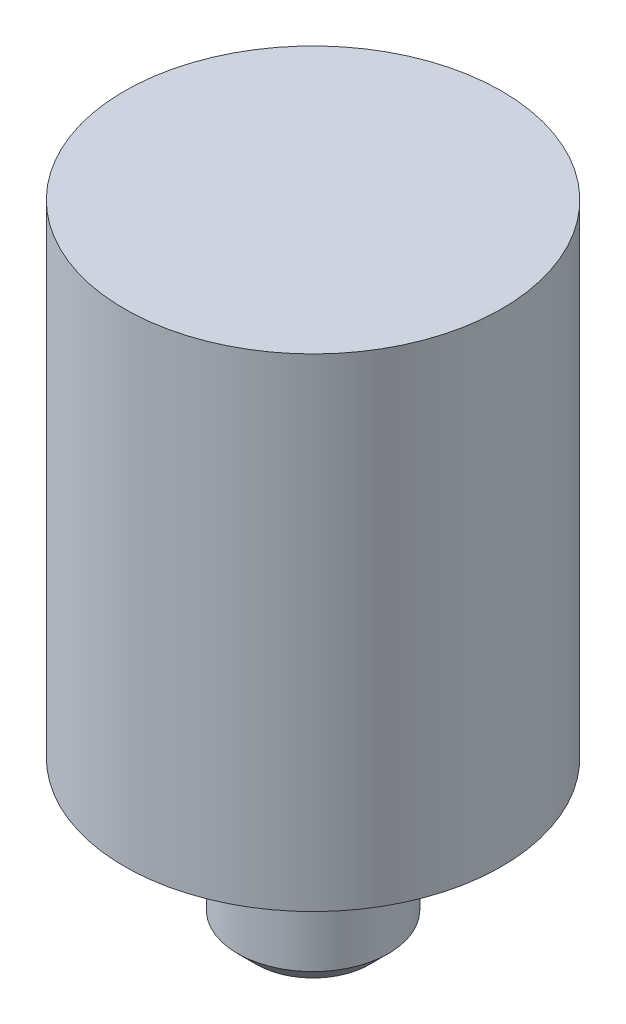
ISO-10303-21;
HEADER;
FILE_DESCRIPTION(('STEP AP214'),'2;1');
FILE_NAME('part.step','',(''),(''),'','','');
FILE_SCHEMA(('AUTOMOTIVE_DESIGN { 1 0 10303 214 1 1 1 1 }'));
ENDSEC;
DATA;
#1=APPLICATION_CONTEXT('core data for automotive mechanical design processes');
#2=APPLICATION_PROTOCOL_DEFINITION('international standard','automotive_design',2000,#1);
#3=PRODUCT_CONTEXT('',#1,'mechanical');
#4=PRODUCT('Part','Part','',(#3));
#5=PRODUCT_RELATED_PRODUCT_CATEGORY('part','',(#4));
#6=PRODUCT_DEFINITION_FORMATION('','',#4);
#7=PRODUCT_DEFINITION_CONTEXT('part definition',#1,'design');
#8=PRODUCT_DEFINITION('design','',#6,#7);
#9=PRODUCT_DEFINITION_SHAPE('','',#8);
#10=(LENGTH_UNIT() NAMED_UNIT(*) SI_UNIT(.MILLI.,.METRE.));
#11=(NAMED_UNIT(*) PLANE_ANGLE_UNIT() SI_UNIT($,.RADIAN.));
#12=(NAMED_UNIT(*) SI_UNIT($,.STERADIAN.) SOLID_ANGLE_UNIT());
#13=UNCERTAINTY_MEASURE_WITH_UNIT(LENGTH_MEASURE(1.E-05),#10,'distance_accuracy_value','');
#14=(GEOMETRIC_REPRESENTATION_CONTEXT(3) GLOBAL_UNCERTAINTY_ASSIGNED_CONTEXT((#13)) GLOBAL_UNIT_ASSIGNED_CONTEXT((#10,
#11,#12)) REPRESENTATION_CONTEXT('',''));
#15=CARTESIAN_POINT('',(0.,0.,0.));
#16=DIRECTION('',(0.,0.,1.));
#17=DIRECTION('',(1.,0.,0.));
#18=AXIS2_PLACEMENT_3D('',#15,#16,#17);
#19=CARTESIAN_POINT('',(0.,-6.35,0.));
#20=DIRECTION('',(0.,-1.,0.));
#21=DIRECTION('',(0.,0.,-1.));
#22=AXIS2_PLACEMENT_3D('',#19,#20,#21);
#23=PLANE('',#22);
#24=CARTESIAN_POINT('',(0.,-6.34999999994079,0.));
#25=DIRECTION('',(0.,1.,0.));
#26=DIRECTION('',(0.,0.,1.));
#27=AXIS2_PLACEMENT_3D('',#24,#25,#26);
#28=CIRCLE('',#27,2.38125000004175);
#29=CARTESIAN_POINT('',(0.,-6.34999999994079,2.38125000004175));
#30=VERTEX_POINT('',#29);
#31=EDGE_CURVE('E17',#30,#30,#28,.T.);
#32=ORIENTED_EDGE('',*,*,#31,.F.);
#33=EDGE_LOOP('',(#32));
#34=FACE_BOUND('',#33,.T.);
#35=ADVANCED_FACE('F14',(#34),#23,.T.);
#36=CARTESIAN_POINT('',(0.,-5.55625000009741,0.));
#37=DIRECTION('',(0.,1.,0.));
#38=DIRECTION('',(0.,0.,1.));
#39=AXIS2_PLACEMENT_3D('',#36,#37,#38);
#40=CONICAL_SURFACE('',#39,3.17499999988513,0.785398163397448);
#41=ORIENTED_EDGE('',*,*,#31,.T.);
#42=EDGE_LOOP('',(#41));
#43=FACE_BOUND('',#42,.T.);
#44=CARTESIAN_POINT('',(0.,-5.55625,0.));
#45=DIRECTION('',(0.,1.,0.));
#46=DIRECTION('',(0.,0.,1.));
#47=AXIS2_PLACEMENT_3D('',#44,#45,#46);
#48=CIRCLE('',#47,3.175);
#49=CARTESIAN_POINT('',(0.,-5.55625,3.175));
#50=VERTEX_POINT('',#49);
#51=EDGE_CURVE('E29',#50,#50,#48,.T.);
#52=ORIENTED_EDGE('',*,*,#51,.F.);
#53=EDGE_LOOP('',(#52));
#54=FACE_BOUND('',#53,.T.);
#55=ADVANCED_FACE('F39',(#43,#54),#40,.T.);
#56=CARTESIAN_POINT('',(0.,-6.35,0.));
#57=DIRECTION('',(0.,1.,0.));
#58=DIRECTION('',(0.,0.,1.));
#59=AXIS2_PLACEMENT_3D('',#56,#57,#58);
#60=CYLINDRICAL_SURFACE('',#59,3.175);
#61=ORIENTED_EDGE('',*,*,#51,.T.);
#62=EDGE_LOOP('',(#61));
#63=FACE_BOUND('',#62,.T.);
#64=CARTESIAN_POINT('',(0.,0.,0.));
#65=DIRECTION('',(0.,1.,0.));
#66=DIRECTION('',(0.,0.,1.));
#67=AXIS2_PLACEMENT_3D('',#64,#65,#66);
#68=CIRCLE('',#67,3.175);
#69=CARTESIAN_POINT('',(0.,0.,3.175));
#70=VERTEX_POINT('',#69);
#71=EDGE_CURVE('E26',#70,#70,#68,.F.);
#72=ORIENTED_EDGE('',*,*,#71,.T.);
#73=EDGE_LOOP('',(#72));
#74=FACE_BOUND('',#73,.T.);
#75=ADVANCED_FACE('F47',(#63,#74),#60,.T.);
#76=CARTESIAN_POINT('',(0.,20.32,0.));
#77=DIRECTION('',(0.,1.,0.));
#78=DIRECTION('',(0.,0.,1.));
#79=AXIS2_PLACEMENT_3D('',#76,#77,#78);
#80=PLANE('',#79);
#81=CARTESIAN_POINT('',(0.,20.32,0.));
#82=DIRECTION('',(0.,-1.,0.));
#83=DIRECTION('',(0.,0.,-1.));
#84=AXIS2_PLACEMENT_3D('',#81,#82,#83);
#85=CIRCLE('',#84,7.9375);
#86=CARTESIAN_POINT('',(0.,20.32,-7.9375));
#87=VERTEX_POINT('',#86);
#88=EDGE_CURVE('E21',#87,#87,#85,.T.);
#89=ORIENTED_EDGE('',*,*,#88,.F.);
#90=EDGE_LOOP('',(#89));
#91=FACE_BOUND('',#90,.T.);
#92=ADVANCED_FACE('F56',(#91),#80,.T.);
#93=CARTESIAN_POINT('',(0.,0.,0.));
#94=DIRECTION('',(0.,1.,0.));
#95=DIRECTION('',(0.,0.,1.));
#96=AXIS2_PLACEMENT_3D('',#93,#94,#95);
#97=PLANE('',#96);
#98=ORIENTED_EDGE('',*,*,#71,.F.);
#99=EDGE_LOOP('',(#98));
#100=FACE_BOUND('',#99,.T.);
#101=CARTESIAN_POINT('',(0.,0.,0.));
#102=DIRECTION('',(0.,-1.,0.));
#103=DIRECTION('',(0.,0.,-1.));
#104=AXIS2_PLACEMENT_3D('',#101,#102,#103);
#105=CIRCLE('',#104,7.9375);
#106=CARTESIAN_POINT('',(0.,0.,-7.9375));
#107=VERTEX_POINT('',#106);
#108=EDGE_CURVE('E10',#107,#107,#105,.F.);
#109=ORIENTED_EDGE('',*,*,#108,.F.);
#110=EDGE_LOOP('',(#109));
#111=FACE_BOUND('',#110,.T.);
#112=ADVANCED_FACE('F50',(#100,#111),#97,.F.);
#113=CARTESIAN_POINT('',(0.,20.32,0.));
#114=DIRECTION('',(0.,-1.,0.));
#115=DIRECTION('',(0.,0.,-1.));
#116=AXIS2_PLACEMENT_3D('',#113,#114,#115);
#117=CYLINDRICAL_SURFACE('',#116,7.9375);
#118=ORIENTED_EDGE('',*,*,#108,.T.);
#119=EDGE_LOOP('',(#118));
#120=FACE_BOUND('',#119,.T.);
#121=ORIENTED_EDGE('',*,*,#88,.T.);
#122=EDGE_LOOP('',(#121));
#123=FACE_BOUND('',#122,.T.);
#124=ADVANCED_FACE('F48',(#120,#123),#117,.T.);
#125=CLOSED_SHELL('',(#35,#55,#75,#92,#112,#124));
#126=MANIFOLD_SOLID_BREP('B1',#125);
#127=ADVANCED_BREP_SHAPE_REPRESENTATION('',(#18,#126),#14);
#128=SHAPE_DEFINITION_REPRESENTATION(#9,#127);
ENDSEC;
END-ISO-10303-21;
